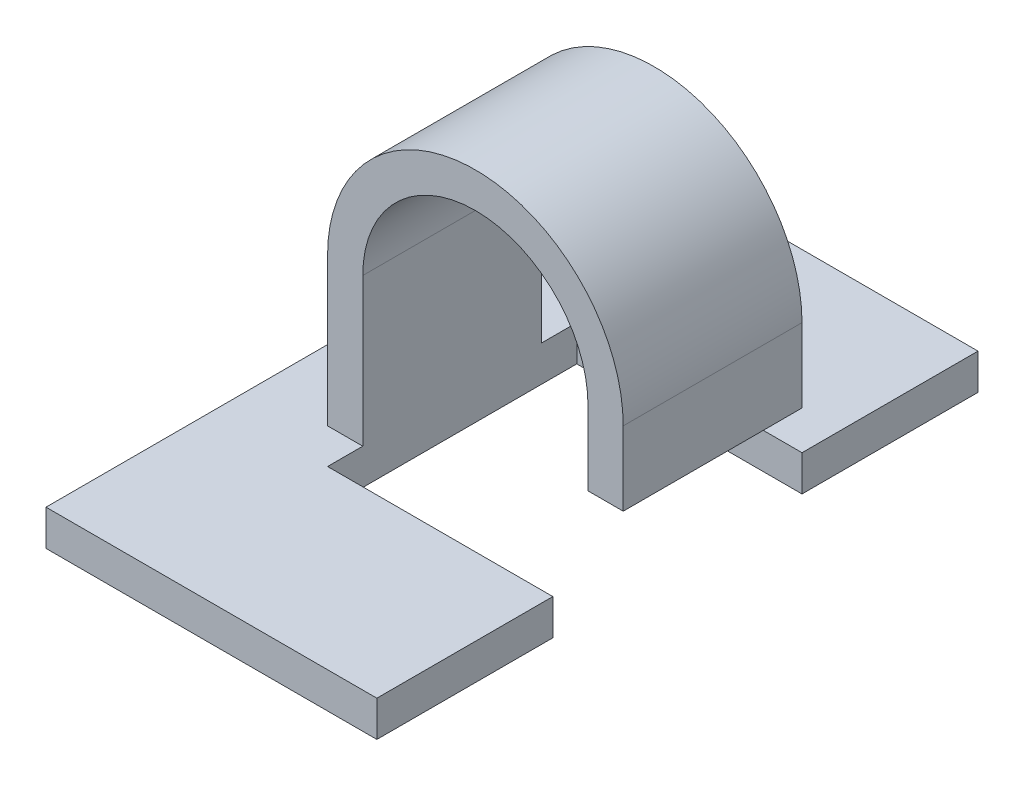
from build123d import *

# Parameters (mm, degrees)
BOSS_EXTRUDE1_DEPTH = 2.54
BOSS_EXTRUDE2_DEPTH = 1.016


with BuildPart() as part:
    # Sketch1 → Boss-Extrude1 (new, symmetric)
    with BuildSketch(Plane.XY):
        with BuildLine():
            Line((3.2, 0), (3.2, -2.1))
            Line((3.2, -2.1), (4.2, -2.1))
            Line((4.2, -2.1), (4.2, 0))
            ThreePointArc((4.2, 0), (0, 4.2), (-4.2, 0))
            Line((-4.2, 0), (-4.2, -4.2))
            Line((-4.2, -4.2), (-3.2, -4.2))
            Line((-3.2, -4.2), (-3.2, 0))
            ThreePointArc((-3.2, 0), (0, 3.2), (3.2, 0))
        make_face()
    extrude(amount=BOSS_EXTRUDE1_DEPTH, both=True)

    # Sketch2 → Boss-Extrude2 (add)
    with BuildSketch(Plane.XZ.offset(4.2)):
        Polygon((-6.2, -8.54), (-6.2, 8.54), (3.2, 8.54), (3.2, 3.54), (-3.2, 3.54), (-3.2, -3.54), (3.2, -3.54), (3.2, -8.54), align=None)
    extrude(amount=BOSS_EXTRUDE2_DEPTH)


solid = part.part
